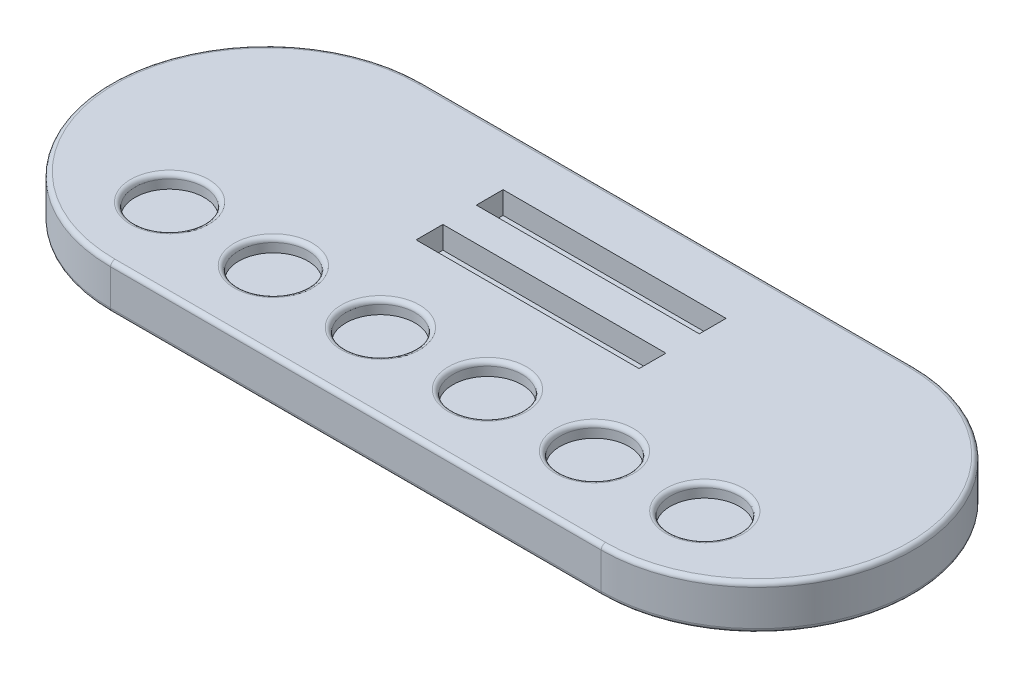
ISO-10303-21;
HEADER;
FILE_DESCRIPTION(('STEP AP214'),'2;1');
FILE_NAME('part.step','',(''),(''),'','','');
FILE_SCHEMA(('AUTOMOTIVE_DESIGN { 1 0 10303 214 1 1 1 1 }'));
ENDSEC;
DATA;
#1=APPLICATION_CONTEXT('core data for automotive mechanical design processes');
#2=APPLICATION_PROTOCOL_DEFINITION('international standard','automotive_design',2000,#1);
#3=PRODUCT_CONTEXT('',#1,'mechanical');
#4=PRODUCT('Part','Part','',(#3));
#5=PRODUCT_RELATED_PRODUCT_CATEGORY('part','',(#4));
#6=PRODUCT_DEFINITION_FORMATION('','',#4);
#7=PRODUCT_DEFINITION_CONTEXT('part definition',#1,'design');
#8=PRODUCT_DEFINITION('design','',#6,#7);
#9=PRODUCT_DEFINITION_SHAPE('','',#8);
#10=(LENGTH_UNIT() NAMED_UNIT(*) SI_UNIT(.MILLI.,.METRE.));
#11=(NAMED_UNIT(*) PLANE_ANGLE_UNIT() SI_UNIT($,.RADIAN.));
#12=(NAMED_UNIT(*) SI_UNIT($,.STERADIAN.) SOLID_ANGLE_UNIT());
#13=UNCERTAINTY_MEASURE_WITH_UNIT(LENGTH_MEASURE(1.E-05),#10,'distance_accuracy_value','');
#14=(GEOMETRIC_REPRESENTATION_CONTEXT(3) GLOBAL_UNCERTAINTY_ASSIGNED_CONTEXT((#13)) GLOBAL_UNIT_ASSIGNED_CONTEXT((#10,
#11,#12)) REPRESENTATION_CONTEXT('',''));
#15=CARTESIAN_POINT('',(0.,0.,0.));
#16=DIRECTION('',(0.,0.,1.));
#17=DIRECTION('',(1.,0.,0.));
#18=AXIS2_PLACEMENT_3D('',#15,#16,#17);
#19=CARTESIAN_POINT('',(-110.,10.,46.));
#20=DIRECTION('',(0.,-1.,0.));
#21=DIRECTION('',(0.,0.,-1.));
#22=AXIS2_PLACEMENT_3D('',#19,#20,#21);
#23=CYLINDRICAL_SURFACE('',#22,70.);
#24=DIRECTION('',(0.,-1.,0.));
#25=VECTOR('',#24,1.);
#26=CARTESIAN_POINT('',(-110.,10.,-24.));
#27=LINE('',#26,#25);
#28=CARTESIAN_POINT('',(-110.,8.,-24.));
#29=VERTEX_POINT('',#28);
#30=CARTESIAN_POINT('',(-110.,-8.,-24.));
#31=VERTEX_POINT('',#30);
#32=EDGE_CURVE('E196',#29,#31,#27,.T.);
#33=ORIENTED_EDGE('',*,*,#32,.T.);
#34=CARTESIAN_POINT('',(-110.,-8.,46.));
#35=DIRECTION('',(0.,-1.,0.));
#36=DIRECTION('',(0.,0.,-1.));
#37=AXIS2_PLACEMENT_3D('',#34,#35,#36);
#38=CIRCLE('',#37,70.);
#39=CARTESIAN_POINT('',(-110.,-8.,116.));
#40=VERTEX_POINT('',#39);
#41=EDGE_CURVE('E214',#31,#40,#38,.F.);
#42=ORIENTED_EDGE('',*,*,#41,.T.);
#43=DIRECTION('',(0.,-1.,0.));
#44=VECTOR('',#43,1.);
#45=CARTESIAN_POINT('',(-110.,10.,116.));
#46=LINE('',#45,#44);
#47=CARTESIAN_POINT('',(-110.,8.,116.));
#48=VERTEX_POINT('',#47);
#49=EDGE_CURVE('E186',#48,#40,#46,.T.);
#50=ORIENTED_EDGE('',*,*,#49,.F.);
#51=CARTESIAN_POINT('',(-110.,8.,46.));
#52=DIRECTION('',(0.,-1.,0.));
#53=DIRECTION('',(0.,0.,-1.));
#54=AXIS2_PLACEMENT_3D('',#51,#52,#53);
#55=CIRCLE('',#54,70.);
#56=EDGE_CURVE('E212',#48,#29,#55,.T.);
#57=ORIENTED_EDGE('',*,*,#56,.T.);
#58=EDGE_LOOP('',(#33,#42,#50,#57));
#59=FACE_BOUND('',#58,.T.);
#60=ADVANCED_FACE('F35',(#59),#23,.T.);
#61=CARTESIAN_POINT('',(-110.,10.,116.));
#62=DIRECTION('',(0.,0.,1.));
#63=DIRECTION('',(1.,0.,0.));
#64=AXIS2_PLACEMENT_3D('',#61,#62,#63);
#65=PLANE('',#64);
#66=ORIENTED_EDGE('',*,*,#49,.T.);
#67=DIRECTION('',(-1.,0.,0.));
#68=VECTOR('',#67,1.);
#69=CARTESIAN_POINT('',(-110.,-8.,116.));
#70=LINE('',#69,#68);
#71=CARTESIAN_POINT('',(110.,-8.,116.));
#72=VERTEX_POINT('',#71);
#73=EDGE_CURVE('E219',#40,#72,#70,.F.);
#74=ORIENTED_EDGE('',*,*,#73,.T.);
#75=DIRECTION('',(0.,-1.,0.));
#76=VECTOR('',#75,1.);
#77=CARTESIAN_POINT('',(110.,10.,116.));
#78=LINE('',#77,#76);
#79=CARTESIAN_POINT('',(110.,8.,116.));
#80=VERTEX_POINT('',#79);
#81=EDGE_CURVE('E190',#80,#72,#78,.T.);
#82=ORIENTED_EDGE('',*,*,#81,.F.);
#83=DIRECTION('',(-1.,0.,0.));
#84=VECTOR('',#83,1.);
#85=CARTESIAN_POINT('',(-110.,8.,116.));
#86=LINE('',#85,#84);
#87=EDGE_CURVE('E216',#80,#48,#86,.T.);
#88=ORIENTED_EDGE('',*,*,#87,.T.);
#89=EDGE_LOOP('',(#66,#74,#82,#88));
#90=FACE_BOUND('',#89,.T.);
#91=ADVANCED_FACE('F301',(#90),#65,.T.);
#92=CARTESIAN_POINT('',(110.,10.,46.));
#93=DIRECTION('',(0.,-1.,0.));
#94=DIRECTION('',(0.,0.,-1.));
#95=AXIS2_PLACEMENT_3D('',#92,#93,#94);
#96=CYLINDRICAL_SURFACE('',#95,70.);
#97=DIRECTION('',(0.,-1.,0.));
#98=VECTOR('',#97,1.);
#99=CARTESIAN_POINT('',(110.,10.,-24.));
#100=LINE('',#99,#98);
#101=CARTESIAN_POINT('',(110.,8.,-24.));
#102=VERTEX_POINT('',#101);
#103=CARTESIAN_POINT('',(110.,-8.,-24.));
#104=VERTEX_POINT('',#103);
#105=EDGE_CURVE('E193',#102,#104,#100,.T.);
#106=ORIENTED_EDGE('',*,*,#105,.F.);
#107=CARTESIAN_POINT('',(110.,8.,46.));
#108=DIRECTION('',(0.,-1.,0.));
#109=DIRECTION('',(0.,0.,-1.));
#110=AXIS2_PLACEMENT_3D('',#107,#108,#109);
#111=CIRCLE('',#110,70.);
#112=EDGE_CURVE('E248',#102,#80,#111,.T.);
#113=ORIENTED_EDGE('',*,*,#112,.T.);
#114=ORIENTED_EDGE('',*,*,#81,.T.);
#115=CARTESIAN_POINT('',(110.,-8.,46.));
#116=DIRECTION('',(0.,-1.,0.));
#117=DIRECTION('',(0.,0.,-1.));
#118=AXIS2_PLACEMENT_3D('',#115,#116,#117);
#119=CIRCLE('',#118,70.);
#120=EDGE_CURVE('E246',#72,#104,#119,.F.);
#121=ORIENTED_EDGE('',*,*,#120,.T.);
#122=EDGE_LOOP('',(#106,#113,#114,#121));
#123=FACE_BOUND('',#122,.T.);
#124=ADVANCED_FACE('F328',(#123),#96,.T.);
#125=CARTESIAN_POINT('',(-110.,10.,-24.));
#126=DIRECTION('',(0.,0.,-1.));
#127=DIRECTION('',(-1.,0.,0.));
#128=AXIS2_PLACEMENT_3D('',#125,#126,#127);
#129=PLANE('',#128);
#130=ORIENTED_EDGE('',*,*,#105,.T.);
#131=DIRECTION('',(1.,0.,0.));
#132=VECTOR('',#131,1.);
#133=CARTESIAN_POINT('',(-110.,-8.,-24.));
#134=LINE('',#133,#132);
#135=EDGE_CURVE('E209',#104,#31,#134,.F.);
#136=ORIENTED_EDGE('',*,*,#135,.T.);
#137=ORIENTED_EDGE('',*,*,#32,.F.);
#138=DIRECTION('',(1.,0.,0.));
#139=VECTOR('',#138,1.);
#140=CARTESIAN_POINT('',(110.,8.,-24.));
#141=LINE('',#140,#139);
#142=EDGE_CURVE('E207',#29,#102,#141,.T.);
#143=ORIENTED_EDGE('',*,*,#142,.T.);
#144=EDGE_LOOP('',(#130,#136,#137,#143));
#145=FACE_BOUND('',#144,.T.);
#146=ADVANCED_FACE('F312',(#145),#129,.T.);
#147=CARTESIAN_POINT('',(-110.,10.,46.));
#148=DIRECTION('',(0.,-1.,0.));
#149=DIRECTION('',(0.,0.,-1.));
#150=AXIS2_PLACEMENT_3D('',#147,#148,#149);
#151=PLANE('',#150);
#152=CARTESIAN_POINT('',(120.,10.,79.5410196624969));
#153=DIRECTION('',(0.,-1.,0.));
#154=DIRECTION('',(0.,0.,-1.));
#155=AXIS2_PLACEMENT_3D('',#152,#153,#154);
#156=CIRCLE('',#155,17.5);
#157=CARTESIAN_POINT('',(120.,10.,62.0410196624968));
#158=VERTEX_POINT('',#157);
#159=EDGE_CURVE('E243',#158,#158,#156,.T.);
#160=ORIENTED_EDGE('',*,*,#159,.T.);
#161=EDGE_LOOP('',(#160));
#162=FACE_BOUND('',#161,.T.);
#163=CARTESIAN_POINT('',(72.,10.,81.));
#164=DIRECTION('',(0.,-1.,0.));
#165=DIRECTION('',(0.,0.,-1.));
#166=AXIS2_PLACEMENT_3D('',#163,#164,#165);
#167=CIRCLE('',#166,17.5);
#168=CARTESIAN_POINT('',(72.,10.,63.5));
#169=VERTEX_POINT('',#168);
#170=EDGE_CURVE('E240',#169,#169,#167,.T.);
#171=ORIENTED_EDGE('',*,*,#170,.T.);
#172=EDGE_LOOP('',(#171));
#173=FACE_BOUND('',#172,.T.);
#174=CARTESIAN_POINT('',(24.,10.,81.));
#175=DIRECTION('',(0.,-1.,0.));
#176=DIRECTION('',(0.,0.,-1.));
#177=AXIS2_PLACEMENT_3D('',#174,#175,#176);
#178=CIRCLE('',#177,17.5);
#179=CARTESIAN_POINT('',(24.,10.,63.5));
#180=VERTEX_POINT('',#179);
#181=EDGE_CURVE('E237',#180,#180,#178,.T.);
#182=ORIENTED_EDGE('',*,*,#181,.T.);
#183=EDGE_LOOP('',(#182));
#184=FACE_BOUND('',#183,.T.);
#185=CARTESIAN_POINT('',(-24.,10.,81.));
#186=DIRECTION('',(0.,-1.,0.));
#187=DIRECTION('',(0.,0.,-1.));
#188=AXIS2_PLACEMENT_3D('',#185,#186,#187);
#189=CIRCLE('',#188,17.5);
#190=CARTESIAN_POINT('',(-24.,10.,63.5));
#191=VERTEX_POINT('',#190);
#192=EDGE_CURVE('E234',#191,#191,#189,.T.);
#193=ORIENTED_EDGE('',*,*,#192,.T.);
#194=EDGE_LOOP('',(#193));
#195=FACE_BOUND('',#194,.T.);
#196=CARTESIAN_POINT('',(-72.,10.,81.));
#197=DIRECTION('',(0.,-1.,0.));
#198=DIRECTION('',(0.,0.,-1.));
#199=AXIS2_PLACEMENT_3D('',#196,#197,#198);
#200=CIRCLE('',#199,17.5);
#201=CARTESIAN_POINT('',(-72.,10.,63.5));
#202=VERTEX_POINT('',#201);
#203=EDGE_CURVE('E231',#202,#202,#200,.T.);
#204=ORIENTED_EDGE('',*,*,#203,.T.);
#205=EDGE_LOOP('',(#204));
#206=FACE_BOUND('',#205,.T.);
#207=CARTESIAN_POINT('',(-120.,10.,79.5410196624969));
#208=DIRECTION('',(0.,-1.,0.));
#209=DIRECTION('',(0.,0.,-1.));
#210=AXIS2_PLACEMENT_3D('',#207,#208,#209);
#211=CIRCLE('',#210,17.5);
#212=CARTESIAN_POINT('',(-120.,10.,62.0410196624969));
#213=VERTEX_POINT('',#212);
#214=EDGE_CURVE('E228',#213,#213,#211,.T.);
#215=ORIENTED_EDGE('',*,*,#214,.T.);
#216=EDGE_LOOP('',(#215));
#217=FACE_BOUND('',#216,.T.);
#218=CARTESIAN_POINT('',(-110.,10.,46.));
#219=DIRECTION('',(0.,-1.,0.));
#220=DIRECTION('',(0.,0.,-1.));
#221=AXIS2_PLACEMENT_3D('',#218,#219,#220);
#222=CIRCLE('',#221,68.);
#223=CARTESIAN_POINT('',(-110.,10.,-22.));
#224=VERTEX_POINT('',#223);
#225=CARTESIAN_POINT('',(-110.,10.,114.));
#226=VERTEX_POINT('',#225);
#227=EDGE_CURVE('E221',#224,#226,#222,.F.);
#228=ORIENTED_EDGE('',*,*,#227,.T.);
#229=DIRECTION('',(-1.,0.,0.));
#230=VECTOR('',#229,1.);
#231=CARTESIAN_POINT('',(110.,10.,114.));
#232=LINE('',#231,#230);
#233=CARTESIAN_POINT('',(110.,10.,114.));
#234=VERTEX_POINT('',#233);
#235=EDGE_CURVE('E226',#226,#234,#232,.F.);
#236=ORIENTED_EDGE('',*,*,#235,.T.);
#237=CARTESIAN_POINT('',(110.,10.,46.));
#238=DIRECTION('',(0.,-1.,0.));
#239=DIRECTION('',(0.,0.,-1.));
#240=AXIS2_PLACEMENT_3D('',#237,#238,#239);
#241=CIRCLE('',#240,68.);
#242=CARTESIAN_POINT('',(110.,10.,-22.));
#243=VERTEX_POINT('',#242);
#244=EDGE_CURVE('E59',#234,#243,#241,.F.);
#245=ORIENTED_EDGE('',*,*,#244,.T.);
#246=DIRECTION('',(1.,0.,0.));
#247=VECTOR('',#246,1.);
#248=CARTESIAN_POINT('',(-110.,10.,-22.));
#249=LINE('',#248,#247);
#250=EDGE_CURVE('E223',#243,#224,#249,.F.);
#251=ORIENTED_EDGE('',*,*,#250,.T.);
#252=EDGE_LOOP('',(#228,#236,#245,#251));
#253=FACE_BOUND('',#252,.T.);
#254=DIRECTION('',(-1.,0.,0.));
#255=VECTOR('',#254,1.);
#256=CARTESIAN_POINT('',(50.,10.,39.));
#257=LINE('',#256,#255);
#258=CARTESIAN_POINT('',(50.,10.,39.));
#259=VERTEX_POINT('',#258);
#260=CARTESIAN_POINT('',(-50.,10.,39.));
#261=VERTEX_POINT('',#260);
#262=EDGE_CURVE('E420',#259,#261,#257,.T.);
#263=ORIENTED_EDGE('',*,*,#262,.T.);
#264=DIRECTION('',(0.,0.,-1.));
#265=VECTOR('',#264,1.);
#266=CARTESIAN_POINT('',(-50.,10.,39.));
#267=LINE('',#266,#265);
#268=CARTESIAN_POINT('',(-50.,10.,27.));
#269=VERTEX_POINT('',#268);
#270=EDGE_CURVE('E410',#261,#269,#267,.T.);
#271=ORIENTED_EDGE('',*,*,#270,.T.);
#272=DIRECTION('',(1.,0.,0.));
#273=VECTOR('',#272,1.);
#274=CARTESIAN_POINT('',(-50.,10.,27.));
#275=LINE('',#274,#273);
#276=CARTESIAN_POINT('',(50.,10.,27.));
#277=VERTEX_POINT('',#276);
#278=EDGE_CURVE('E413',#269,#277,#275,.T.);
#279=ORIENTED_EDGE('',*,*,#278,.T.);
#280=DIRECTION('',(0.,0.,1.));
#281=VECTOR('',#280,1.);
#282=CARTESIAN_POINT('',(50.,10.,27.));
#283=LINE('',#282,#281);
#284=EDGE_CURVE('E417',#277,#259,#283,.T.);
#285=ORIENTED_EDGE('',*,*,#284,.T.);
#286=EDGE_LOOP('',(#263,#271,#279,#285));
#287=FACE_BOUND('',#286,.T.);
#288=DIRECTION('',(-1.,0.,0.));
#289=VECTOR('',#288,1.);
#290=CARTESIAN_POINT('',(50.,10.,12.));
#291=LINE('',#290,#289);
#292=CARTESIAN_POINT('',(50.,10.,12.));
#293=VERTEX_POINT('',#292);
#294=CARTESIAN_POINT('',(-50.,10.,12.));
#295=VERTEX_POINT('',#294);
#296=EDGE_CURVE('E177',#293,#295,#291,.T.);
#297=ORIENTED_EDGE('',*,*,#296,.T.);
#298=DIRECTION('',(0.,0.,-1.));
#299=VECTOR('',#298,1.);
#300=CARTESIAN_POINT('',(-50.,10.,12.));
#301=LINE('',#300,#299);
#302=CARTESIAN_POINT('',(-50.,10.,0.));
#303=VERTEX_POINT('',#302);
#304=EDGE_CURVE('E444',#295,#303,#301,.T.);
#305=ORIENTED_EDGE('',*,*,#304,.T.);
#306=DIRECTION('',(1.,0.,0.));
#307=VECTOR('',#306,1.);
#308=CARTESIAN_POINT('',(-50.,10.,0.));
#309=LINE('',#308,#307);
#310=CARTESIAN_POINT('',(50.,10.,0.));
#311=VERTEX_POINT('',#310);
#312=EDGE_CURVE('E174',#303,#311,#309,.T.);
#313=ORIENTED_EDGE('',*,*,#312,.T.);
#314=DIRECTION('',(0.,0.,1.));
#315=VECTOR('',#314,1.);
#316=CARTESIAN_POINT('',(50.,10.,0.));
#317=LINE('',#316,#315);
#318=EDGE_CURVE('E182',#311,#293,#317,.T.);
#319=ORIENTED_EDGE('',*,*,#318,.T.);
#320=EDGE_LOOP('',(#297,#305,#313,#319));
#321=FACE_BOUND('',#320,.T.);
#322=ADVANCED_FACE('F291',(#162,#173,#184,#195,#206,#217,#253,#287,#321),#151,.F.);
#323=CARTESIAN_POINT('',(-50.,10.,12.));
#324=DIRECTION('',(-1.,0.,0.));
#325=DIRECTION('',(0.,0.,1.));
#326=AXIS2_PLACEMENT_3D('',#323,#324,#325);
#327=PLANE('',#326);
#328=DIRECTION('',(0.,0.,-1.));
#329=VECTOR('',#328,1.);
#330=CARTESIAN_POINT('',(-50.,0.,12.));
#331=LINE('',#330,#329);
#332=CARTESIAN_POINT('',(-50.,0.,12.));
#333=VERTEX_POINT('',#332);
#334=CARTESIAN_POINT('',(-50.,0.,0.));
#335=VERTEX_POINT('',#334);
#336=EDGE_CURVE('E154',#333,#335,#331,.T.);
#337=ORIENTED_EDGE('',*,*,#336,.T.);
#338=DIRECTION('',(0.,-1.,0.));
#339=VECTOR('',#338,1.);
#340=CARTESIAN_POINT('',(-50.,10.,0.));
#341=LINE('',#340,#339);
#342=EDGE_CURVE('E166',#303,#335,#341,.T.);
#343=ORIENTED_EDGE('',*,*,#342,.F.);
#344=ORIENTED_EDGE('',*,*,#304,.F.);
#345=DIRECTION('',(0.,-1.,0.));
#346=VECTOR('',#345,1.);
#347=CARTESIAN_POINT('',(-50.,10.,12.));
#348=LINE('',#347,#346);
#349=EDGE_CURVE('E168',#295,#333,#348,.T.);
#350=ORIENTED_EDGE('',*,*,#349,.T.);
#351=EDGE_LOOP('',(#337,#343,#344,#350));
#352=FACE_BOUND('',#351,.T.);
#353=ADVANCED_FACE('F164',(#352),#327,.F.);
#354=CARTESIAN_POINT('',(50.,10.,12.));
#355=DIRECTION('',(0.,0.,1.));
#356=DIRECTION('',(1.,0.,0.));
#357=AXIS2_PLACEMENT_3D('',#354,#355,#356);
#358=PLANE('',#357);
#359=DIRECTION('',(-1.,0.,0.));
#360=VECTOR('',#359,1.);
#361=CARTESIAN_POINT('',(50.,0.,12.));
#362=LINE('',#361,#360);
#363=CARTESIAN_POINT('',(50.,0.,12.));
#364=VERTEX_POINT('',#363);
#365=EDGE_CURVE('E446',#364,#333,#362,.T.);
#366=ORIENTED_EDGE('',*,*,#365,.T.);
#367=ORIENTED_EDGE('',*,*,#349,.F.);
#368=ORIENTED_EDGE('',*,*,#296,.F.);
#369=DIRECTION('',(0.,-1.,0.));
#370=VECTOR('',#369,1.);
#371=CARTESIAN_POINT('',(50.,10.,12.));
#372=LINE('',#371,#370);
#373=EDGE_CURVE('E179',#293,#364,#372,.T.);
#374=ORIENTED_EDGE('',*,*,#373,.T.);
#375=EDGE_LOOP('',(#366,#367,#368,#374));
#376=FACE_BOUND('',#375,.T.);
#377=ADVANCED_FACE('F455',(#376),#358,.F.);
#378=CARTESIAN_POINT('',(50.,10.,0.));
#379=DIRECTION('',(1.,0.,0.));
#380=DIRECTION('',(0.,0.,-1.));
#381=AXIS2_PLACEMENT_3D('',#378,#379,#380);
#382=PLANE('',#381);
#383=DIRECTION('',(0.,0.,1.));
#384=VECTOR('',#383,1.);
#385=CARTESIAN_POINT('',(50.,0.,0.));
#386=LINE('',#385,#384);
#387=CARTESIAN_POINT('',(50.,0.,0.));
#388=VERTEX_POINT('',#387);
#389=EDGE_CURVE('E157',#388,#364,#386,.T.);
#390=ORIENTED_EDGE('',*,*,#389,.T.);
#391=ORIENTED_EDGE('',*,*,#373,.F.);
#392=ORIENTED_EDGE('',*,*,#318,.F.);
#393=DIRECTION('',(0.,-1.,0.));
#394=VECTOR('',#393,1.);
#395=CARTESIAN_POINT('',(50.,10.,0.));
#396=LINE('',#395,#394);
#397=EDGE_CURVE('E176',#311,#388,#396,.T.);
#398=ORIENTED_EDGE('',*,*,#397,.T.);
#399=EDGE_LOOP('',(#390,#391,#392,#398));
#400=FACE_BOUND('',#399,.T.);
#401=ADVANCED_FACE('F457',(#400),#382,.F.);
#402=CARTESIAN_POINT('',(-50.,10.,0.));
#403=DIRECTION('',(0.,0.,-1.));
#404=DIRECTION('',(-1.,0.,0.));
#405=AXIS2_PLACEMENT_3D('',#402,#403,#404);
#406=PLANE('',#405);
#407=DIRECTION('',(1.,0.,0.));
#408=VECTOR('',#407,1.);
#409=CARTESIAN_POINT('',(-50.,0.,0.));
#410=LINE('',#409,#408);
#411=EDGE_CURVE('E151',#335,#388,#410,.T.);
#412=ORIENTED_EDGE('',*,*,#411,.T.);
#413=ORIENTED_EDGE('',*,*,#397,.F.);
#414=ORIENTED_EDGE('',*,*,#312,.F.);
#415=ORIENTED_EDGE('',*,*,#342,.T.);
#416=EDGE_LOOP('',(#412,#413,#414,#415));
#417=FACE_BOUND('',#416,.T.);
#418=ADVANCED_FACE('F172',(#417),#406,.F.);
#419=CARTESIAN_POINT('',(-50.,10.,39.));
#420=DIRECTION('',(-1.,0.,0.));
#421=DIRECTION('',(0.,0.,1.));
#422=AXIS2_PLACEMENT_3D('',#419,#420,#421);
#423=PLANE('',#422);
#424=DIRECTION('',(0.,0.,-1.));
#425=VECTOR('',#424,1.);
#426=CARTESIAN_POINT('',(-50.,0.,39.));
#427=LINE('',#426,#425);
#428=CARTESIAN_POINT('',(-50.,0.,39.));
#429=VERTEX_POINT('',#428);
#430=CARTESIAN_POINT('',(-50.,0.,27.));
#431=VERTEX_POINT('',#430);
#432=EDGE_CURVE('E398',#429,#431,#427,.T.);
#433=ORIENTED_EDGE('',*,*,#432,.T.);
#434=DIRECTION('',(0.,-1.,0.));
#435=VECTOR('',#434,1.);
#436=CARTESIAN_POINT('',(-50.,10.,27.));
#437=LINE('',#436,#435);
#438=EDGE_CURVE('E423',#269,#431,#437,.T.);
#439=ORIENTED_EDGE('',*,*,#438,.F.);
#440=ORIENTED_EDGE('',*,*,#270,.F.);
#441=DIRECTION('',(0.,-1.,0.));
#442=VECTOR('',#441,1.);
#443=CARTESIAN_POINT('',(-50.,10.,39.));
#444=LINE('',#443,#442);
#445=EDGE_CURVE('E170',#261,#429,#444,.T.);
#446=ORIENTED_EDGE('',*,*,#445,.T.);
#447=EDGE_LOOP('',(#433,#439,#440,#446));
#448=FACE_BOUND('',#447,.T.);
#449=ADVANCED_FACE('F470',(#448),#423,.F.);
#450=CARTESIAN_POINT('',(50.,10.,39.));
#451=DIRECTION('',(0.,0.,1.));
#452=DIRECTION('',(1.,0.,0.));
#453=AXIS2_PLACEMENT_3D('',#450,#451,#452);
#454=PLANE('',#453);
#455=DIRECTION('',(-1.,0.,0.));
#456=VECTOR('',#455,1.);
#457=CARTESIAN_POINT('',(50.,0.,39.));
#458=LINE('',#457,#456);
#459=CARTESIAN_POINT('',(50.,0.,39.));
#460=VERTEX_POINT('',#459);
#461=EDGE_CURVE('E414',#460,#429,#458,.T.);
#462=ORIENTED_EDGE('',*,*,#461,.T.);
#463=ORIENTED_EDGE('',*,*,#445,.F.);
#464=ORIENTED_EDGE('',*,*,#262,.F.);
#465=DIRECTION('',(0.,-1.,0.));
#466=VECTOR('',#465,1.);
#467=CARTESIAN_POINT('',(50.,10.,39.));
#468=LINE('',#467,#466);
#469=EDGE_CURVE('E436',#259,#460,#468,.T.);
#470=ORIENTED_EDGE('',*,*,#469,.T.);
#471=EDGE_LOOP('',(#462,#463,#464,#470));
#472=FACE_BOUND('',#471,.T.);
#473=ADVANCED_FACE('F477',(#472),#454,.F.);
#474=CARTESIAN_POINT('',(50.,10.,27.));
#475=DIRECTION('',(1.,0.,0.));
#476=DIRECTION('',(0.,0.,-1.));
#477=AXIS2_PLACEMENT_3D('',#474,#475,#476);
#478=PLANE('',#477);
#479=DIRECTION('',(0.,0.,1.));
#480=VECTOR('',#479,1.);
#481=CARTESIAN_POINT('',(50.,0.,27.));
#482=LINE('',#481,#480);
#483=CARTESIAN_POINT('',(50.,0.,27.));
#484=VERTEX_POINT('',#483);
#485=EDGE_CURVE('E429',#484,#460,#482,.T.);
#486=ORIENTED_EDGE('',*,*,#485,.T.);
#487=ORIENTED_EDGE('',*,*,#469,.F.);
#488=ORIENTED_EDGE('',*,*,#284,.F.);
#489=DIRECTION('',(0.,-1.,0.));
#490=VECTOR('',#489,1.);
#491=CARTESIAN_POINT('',(50.,10.,27.));
#492=LINE('',#491,#490);
#493=EDGE_CURVE('E439',#277,#484,#492,.T.);
#494=ORIENTED_EDGE('',*,*,#493,.T.);
#495=EDGE_LOOP('',(#486,#487,#488,#494));
#496=FACE_BOUND('',#495,.T.);
#497=ADVANCED_FACE('F482',(#496),#478,.F.);
#498=CARTESIAN_POINT('',(-50.,10.,27.));
#499=DIRECTION('',(0.,0.,-1.));
#500=DIRECTION('',(-1.,0.,0.));
#501=AXIS2_PLACEMENT_3D('',#498,#499,#500);
#502=PLANE('',#501);
#503=DIRECTION('',(1.,0.,0.));
#504=VECTOR('',#503,1.);
#505=CARTESIAN_POINT('',(-50.,0.,27.));
#506=LINE('',#505,#504);
#507=EDGE_CURVE('E426',#431,#484,#506,.T.);
#508=ORIENTED_EDGE('',*,*,#507,.T.);
#509=ORIENTED_EDGE('',*,*,#493,.F.);
#510=ORIENTED_EDGE('',*,*,#278,.F.);
#511=ORIENTED_EDGE('',*,*,#438,.T.);
#512=EDGE_LOOP('',(#508,#509,#510,#511));
#513=FACE_BOUND('',#512,.T.);
#514=ADVANCED_FACE('F479',(#513),#502,.F.);
#515=CARTESIAN_POINT('',(-110.,0.,46.));
#516=DIRECTION('',(0.,-1.,0.));
#517=DIRECTION('',(0.,0.,-1.));
#518=AXIS2_PLACEMENT_3D('',#515,#516,#517);
#519=PLANE('',#518);
#520=ORIENTED_EDGE('',*,*,#336,.F.);
#521=ORIENTED_EDGE('',*,*,#365,.F.);
#522=ORIENTED_EDGE('',*,*,#389,.F.);
#523=ORIENTED_EDGE('',*,*,#411,.F.);
#524=EDGE_LOOP('',(#520,#521,#522,#523));
#525=FACE_BOUND('',#524,.T.);
#526=ADVANCED_FACE('F153',(#525),#519,.F.);
#527=ORIENTED_EDGE('',*,*,#432,.F.);
#528=ORIENTED_EDGE('',*,*,#461,.F.);
#529=ORIENTED_EDGE('',*,*,#485,.F.);
#530=ORIENTED_EDGE('',*,*,#507,.F.);
#531=EDGE_LOOP('',(#527,#528,#529,#530));
#532=FACE_BOUND('',#531,.T.);
#533=ADVANCED_FACE('F492',(#532),#519,.F.);
#534=CARTESIAN_POINT('',(-110.,-10.,46.));
#535=DIRECTION('',(0.,-1.,0.));
#536=DIRECTION('',(0.,0.,-1.));
#537=AXIS2_PLACEMENT_3D('',#534,#535,#536);
#538=PLANE('',#537);
#539=CARTESIAN_POINT('',(-110.,-10.,46.));
#540=DIRECTION('',(0.,-1.,0.));
#541=DIRECTION('',(0.,0.,-1.));
#542=AXIS2_PLACEMENT_3D('',#539,#540,#541);
#543=CIRCLE('',#542,68.);
#544=CARTESIAN_POINT('',(-110.,-10.,114.));
#545=VERTEX_POINT('',#544);
#546=CARTESIAN_POINT('',(-110.,-10.,-22.));
#547=VERTEX_POINT('',#546);
#548=EDGE_CURVE('E202',#545,#547,#543,.T.);
#549=ORIENTED_EDGE('',*,*,#548,.T.);
#550=DIRECTION('',(1.,0.,0.));
#551=VECTOR('',#550,1.);
#552=CARTESIAN_POINT('',(-110.,-10.,-22.));
#553=LINE('',#552,#551);
#554=CARTESIAN_POINT('',(110.,-10.,-22.));
#555=VERTEX_POINT('',#554);
#556=EDGE_CURVE('E204',#547,#555,#553,.T.);
#557=ORIENTED_EDGE('',*,*,#556,.T.);
#558=CARTESIAN_POINT('',(110.,-10.,46.));
#559=DIRECTION('',(0.,-1.,0.));
#560=DIRECTION('',(0.,0.,-1.));
#561=AXIS2_PLACEMENT_3D('',#558,#559,#560);
#562=CIRCLE('',#561,68.);
#563=CARTESIAN_POINT('',(110.,-10.,114.));
#564=VERTEX_POINT('',#563);
#565=EDGE_CURVE('E189',#555,#564,#562,.T.);
#566=ORIENTED_EDGE('',*,*,#565,.T.);
#567=DIRECTION('',(-1.,0.,0.));
#568=VECTOR('',#567,1.);
#569=CARTESIAN_POINT('',(-110.,-10.,114.));
#570=LINE('',#569,#568);
#571=EDGE_CURVE('E200',#564,#545,#570,.T.);
#572=ORIENTED_EDGE('',*,*,#571,.T.);
#573=EDGE_LOOP('',(#549,#557,#566,#572));
#574=FACE_BOUND('',#573,.T.);
#575=ADVANCED_FACE('F324',(#574),#538,.T.);
#576=CARTESIAN_POINT('',(-24.,4.,81.));
#577=DIRECTION('',(0.,1.,0.));
#578=DIRECTION('',(0.,0.,1.));
#579=AXIS2_PLACEMENT_3D('',#576,#577,#578);
#580=CYLINDRICAL_SURFACE('',#579,15.5);
#581=CARTESIAN_POINT('',(-24.,8.,81.));
#582=DIRECTION('',(0.,-1.,0.));
#583=DIRECTION('',(0.,0.,-1.));
#584=AXIS2_PLACEMENT_3D('',#581,#582,#583);
#585=CIRCLE('',#584,15.5);
#586=CARTESIAN_POINT('',(-24.,8.,65.5));
#587=VERTEX_POINT('',#586);
#588=EDGE_CURVE('E259',#587,#587,#585,.F.);
#589=ORIENTED_EDGE('',*,*,#588,.T.);
#590=EDGE_LOOP('',(#589));
#591=FACE_BOUND('',#590,.T.);
#592=CARTESIAN_POINT('',(-24.,4.,81.));
#593=DIRECTION('',(0.,1.,0.));
#594=DIRECTION('',(0.,0.,1.));
#595=AXIS2_PLACEMENT_3D('',#592,#593,#594);
#596=CIRCLE('',#595,15.5);
#597=CARTESIAN_POINT('',(-24.,4.,96.5));
#598=VERTEX_POINT('',#597);
#599=EDGE_CURVE('E394',#598,#598,#596,.T.);
#600=ORIENTED_EDGE('',*,*,#599,.F.);
#601=EDGE_LOOP('',(#600));
#602=FACE_BOUND('',#601,.T.);
#603=ADVANCED_FACE('F495',(#591,#602),#580,.F.);
#604=CARTESIAN_POINT('',(-24.,4.,81.));
#605=DIRECTION('',(0.,1.,0.));
#606=DIRECTION('',(0.,0.,1.));
#607=AXIS2_PLACEMENT_3D('',#604,#605,#606);
#608=PLANE('',#607);
#609=ORIENTED_EDGE('',*,*,#599,.T.);
#610=EDGE_LOOP('',(#609));
#611=FACE_BOUND('',#610,.T.);
#612=ADVANCED_FACE('F498',(#611),#608,.T.);
#613=CARTESIAN_POINT('',(24.,4.,81.));
#614=DIRECTION('',(0.,1.,0.));
#615=DIRECTION('',(0.,0.,1.));
#616=AXIS2_PLACEMENT_3D('',#613,#614,#615);
#617=CYLINDRICAL_SURFACE('',#616,15.5);
#618=CARTESIAN_POINT('',(24.,8.,81.));
#619=DIRECTION('',(0.,-1.,0.));
#620=DIRECTION('',(0.,0.,-1.));
#621=AXIS2_PLACEMENT_3D('',#618,#619,#620);
#622=CIRCLE('',#621,15.5);
#623=CARTESIAN_POINT('',(24.,8.,65.5));
#624=VERTEX_POINT('',#623);
#625=EDGE_CURVE('E256',#624,#624,#622,.F.);
#626=ORIENTED_EDGE('',*,*,#625,.T.);
#627=EDGE_LOOP('',(#626));
#628=FACE_BOUND('',#627,.T.);
#629=CARTESIAN_POINT('',(24.,4.,81.));
#630=DIRECTION('',(0.,1.,0.));
#631=DIRECTION('',(0.,0.,-1.));
#632=AXIS2_PLACEMENT_3D('',#629,#630,#631);
#633=CIRCLE('',#632,15.5);
#634=CARTESIAN_POINT('',(24.,4.,65.5));
#635=VERTEX_POINT('',#634);
#636=EDGE_CURVE('E274',#635,#635,#633,.T.);
#637=ORIENTED_EDGE('',*,*,#636,.F.);
#638=EDGE_LOOP('',(#637));
#639=FACE_BOUND('',#638,.T.);
#640=ADVANCED_FACE('F502',(#628,#639),#617,.F.);
#641=CARTESIAN_POINT('',(24.,4.,81.));
#642=DIRECTION('',(0.,-1.,0.));
#643=DIRECTION('',(0.,0.,-1.));
#644=AXIS2_PLACEMENT_3D('',#641,#642,#643);
#645=PLANE('',#644);
#646=ORIENTED_EDGE('',*,*,#636,.T.);
#647=EDGE_LOOP('',(#646));
#648=FACE_BOUND('',#647,.T.);
#649=ADVANCED_FACE('F508',(#648),#645,.F.);
#650=CARTESIAN_POINT('',(72.,4.,81.));
#651=DIRECTION('',(0.,1.,0.));
#652=DIRECTION('',(0.,0.,1.));
#653=AXIS2_PLACEMENT_3D('',#650,#651,#652);
#654=CYLINDRICAL_SURFACE('',#653,15.5);
#655=CARTESIAN_POINT('',(72.,8.,81.));
#656=DIRECTION('',(0.,-1.,0.));
#657=DIRECTION('',(0.,0.,-1.));
#658=AXIS2_PLACEMENT_3D('',#655,#656,#657);
#659=CIRCLE('',#658,15.5);
#660=CARTESIAN_POINT('',(72.,8.,65.5));
#661=VERTEX_POINT('',#660);
#662=EDGE_CURVE('E253',#661,#661,#659,.F.);
#663=ORIENTED_EDGE('',*,*,#662,.T.);
#664=EDGE_LOOP('',(#663));
#665=FACE_BOUND('',#664,.T.);
#666=CARTESIAN_POINT('',(72.,4.,81.));
#667=DIRECTION('',(0.,1.,0.));
#668=DIRECTION('',(0.,0.,-1.));
#669=AXIS2_PLACEMENT_3D('',#666,#667,#668);
#670=CIRCLE('',#669,15.5);
#671=CARTESIAN_POINT('',(72.,4.,65.5));
#672=VERTEX_POINT('',#671);
#673=EDGE_CURVE('E407',#672,#672,#670,.T.);
#674=ORIENTED_EDGE('',*,*,#673,.F.);
#675=EDGE_LOOP('',(#674));
#676=FACE_BOUND('',#675,.T.);
#677=ADVANCED_FACE('F504',(#665,#676),#654,.F.);
#678=CARTESIAN_POINT('',(72.,4.,81.));
#679=DIRECTION('',(0.,-1.,0.));
#680=DIRECTION('',(0.,0.,-1.));
#681=AXIS2_PLACEMENT_3D('',#678,#679,#680);
#682=PLANE('',#681);
#683=ORIENTED_EDGE('',*,*,#673,.T.);
#684=EDGE_LOOP('',(#683));
#685=FACE_BOUND('',#684,.T.);
#686=ADVANCED_FACE('F507',(#685),#682,.F.);
#687=CARTESIAN_POINT('',(120.,4.,79.5410196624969));
#688=DIRECTION('',(0.,1.,0.));
#689=DIRECTION('',(0.,0.,1.));
#690=AXIS2_PLACEMENT_3D('',#687,#688,#689);
#691=CYLINDRICAL_SURFACE('',#690,15.5);
#692=CARTESIAN_POINT('',(120.,8.,79.5410196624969));
#693=DIRECTION('',(0.,-1.,0.));
#694=DIRECTION('',(0.,0.,-1.));
#695=AXIS2_PLACEMENT_3D('',#692,#693,#694);
#696=CIRCLE('',#695,15.5);
#697=CARTESIAN_POINT('',(120.,8.,64.0410196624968));
#698=VERTEX_POINT('',#697);
#699=EDGE_CURVE('E250',#698,#698,#696,.F.);
#700=ORIENTED_EDGE('',*,*,#699,.T.);
#701=EDGE_LOOP('',(#700));
#702=FACE_BOUND('',#701,.T.);
#703=CARTESIAN_POINT('',(120.,4.,79.5410196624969));
#704=DIRECTION('',(0.,1.,0.));
#705=DIRECTION('',(0.,0.,-1.));
#706=AXIS2_PLACEMENT_3D('',#703,#704,#705);
#707=CIRCLE('',#706,15.5);
#708=CARTESIAN_POINT('',(120.,4.,64.0410196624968));
#709=VERTEX_POINT('',#708);
#710=EDGE_CURVE('E401',#709,#709,#707,.T.);
#711=ORIENTED_EDGE('',*,*,#710,.F.);
#712=EDGE_LOOP('',(#711));
#713=FACE_BOUND('',#712,.T.);
#714=ADVANCED_FACE('F512',(#702,#713),#691,.F.);
#715=CARTESIAN_POINT('',(120.,4.,79.5410196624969));
#716=DIRECTION('',(0.,-1.,0.));
#717=DIRECTION('',(0.,0.,-1.));
#718=AXIS2_PLACEMENT_3D('',#715,#716,#717);
#719=PLANE('',#718);
#720=ORIENTED_EDGE('',*,*,#710,.T.);
#721=EDGE_LOOP('',(#720));
#722=FACE_BOUND('',#721,.T.);
#723=ADVANCED_FACE('F516',(#722),#719,.F.);
#724=CARTESIAN_POINT('',(-120.,4.,79.5410196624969));
#725=DIRECTION('',(0.,1.,0.));
#726=DIRECTION('',(0.,0.,1.));
#727=AXIS2_PLACEMENT_3D('',#724,#725,#726);
#728=CYLINDRICAL_SURFACE('',#727,15.5);
#729=CARTESIAN_POINT('',(-120.,8.,79.5410196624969));
#730=DIRECTION('',(0.,-1.,0.));
#731=DIRECTION('',(0.,0.,-1.));
#732=AXIS2_PLACEMENT_3D('',#729,#730,#731);
#733=CIRCLE('',#732,15.5);
#734=CARTESIAN_POINT('',(-120.,8.,64.0410196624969));
#735=VERTEX_POINT('',#734);
#736=EDGE_CURVE('E11',#735,#735,#733,.F.);
#737=ORIENTED_EDGE('',*,*,#736,.T.);
#738=EDGE_LOOP('',(#737));
#739=FACE_BOUND('',#738,.T.);
#740=CARTESIAN_POINT('',(-120.,4.,79.5410196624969));
#741=DIRECTION('',(0.,1.,0.));
#742=DIRECTION('',(0.,0.,1.));
#743=AXIS2_PLACEMENT_3D('',#740,#741,#742);
#744=CIRCLE('',#743,15.5);
#745=CARTESIAN_POINT('',(-120.,4.,95.0410196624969));
#746=VERTEX_POINT('',#745);
#747=EDGE_CURVE('E395',#746,#746,#744,.T.);
#748=ORIENTED_EDGE('',*,*,#747,.F.);
#749=EDGE_LOOP('',(#748));
#750=FACE_BOUND('',#749,.T.);
#751=ADVANCED_FACE('F520',(#739,#750),#728,.F.);
#752=CARTESIAN_POINT('',(-120.,4.,79.5410196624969));
#753=DIRECTION('',(0.,1.,0.));
#754=DIRECTION('',(0.,0.,1.));
#755=AXIS2_PLACEMENT_3D('',#752,#753,#754);
#756=PLANE('',#755);
#757=ORIENTED_EDGE('',*,*,#747,.T.);
#758=EDGE_LOOP('',(#757));
#759=FACE_BOUND('',#758,.T.);
#760=ADVANCED_FACE('F388',(#759),#756,.T.);
#761=CARTESIAN_POINT('',(-72.,4.,81.));
#762=DIRECTION('',(0.,1.,0.));
#763=DIRECTION('',(0.,0.,1.));
#764=AXIS2_PLACEMENT_3D('',#761,#762,#763);
#765=CYLINDRICAL_SURFACE('',#764,15.5);
#766=CARTESIAN_POINT('',(-72.,8.,81.));
#767=DIRECTION('',(0.,-1.,0.));
#768=DIRECTION('',(0.,0.,-1.));
#769=AXIS2_PLACEMENT_3D('',#766,#767,#768);
#770=CIRCLE('',#769,15.5);
#771=CARTESIAN_POINT('',(-72.,8.,65.5));
#772=VERTEX_POINT('',#771);
#773=EDGE_CURVE('E44',#772,#772,#770,.F.);
#774=ORIENTED_EDGE('',*,*,#773,.T.);
#775=EDGE_LOOP('',(#774));
#776=FACE_BOUND('',#775,.T.);
#777=CARTESIAN_POINT('',(-72.,4.,81.));
#778=DIRECTION('',(0.,1.,0.));
#779=DIRECTION('',(0.,0.,1.));
#780=AXIS2_PLACEMENT_3D('',#777,#778,#779);
#781=CIRCLE('',#780,15.5);
#782=CARTESIAN_POINT('',(-72.,4.,96.5));
#783=VERTEX_POINT('',#782);
#784=EDGE_CURVE('E392',#783,#783,#781,.T.);
#785=ORIENTED_EDGE('',*,*,#784,.F.);
#786=EDGE_LOOP('',(#785));
#787=FACE_BOUND('',#786,.T.);
#788=ADVANCED_FACE('F385',(#776,#787),#765,.F.);
#789=CARTESIAN_POINT('',(-72.,4.,81.));
#790=DIRECTION('',(0.,1.,0.));
#791=DIRECTION('',(0.,0.,1.));
#792=AXIS2_PLACEMENT_3D('',#789,#790,#791);
#793=PLANE('',#792);
#794=ORIENTED_EDGE('',*,*,#784,.T.);
#795=EDGE_LOOP('',(#794));
#796=FACE_BOUND('',#795,.T.);
#797=ADVANCED_FACE('F350',(#796),#793,.T.);
#798=CARTESIAN_POINT('',(-110.,-8.,114.));
#799=DIRECTION('',(-1.,0.,0.));
#800=DIRECTION('',(0.,0.,1.));
#801=AXIS2_PLACEMENT_3D('',#798,#799,#800);
#802=CYLINDRICAL_SURFACE('',#801,2.);
#803=CARTESIAN_POINT('',(110.,-8.,114.));
#804=DIRECTION('',(1.,0.,0.));
#805=DIRECTION('',(0.,0.,-1.));
#806=AXIS2_PLACEMENT_3D('',#803,#804,#805);
#807=CIRCLE('',#806,2.);
#808=EDGE_CURVE('E268',#72,#564,#807,.T.);
#809=ORIENTED_EDGE('',*,*,#808,.F.);
#810=ORIENTED_EDGE('',*,*,#73,.F.);
#811=CARTESIAN_POINT('',(-110.,-8.,114.));
#812=DIRECTION('',(-1.,0.,0.));
#813=DIRECTION('',(0.,0.,1.));
#814=AXIS2_PLACEMENT_3D('',#811,#812,#813);
#815=CIRCLE('',#814,2.);
#816=EDGE_CURVE('E271',#545,#40,#815,.T.);
#817=ORIENTED_EDGE('',*,*,#816,.F.);
#818=ORIENTED_EDGE('',*,*,#571,.F.);
#819=EDGE_LOOP('',(#809,#810,#817,#818));
#820=FACE_BOUND('',#819,.T.);
#821=ADVANCED_FACE('F326',(#820),#802,.T.);
#822=CARTESIAN_POINT('',(-110.,-8.,46.));
#823=DIRECTION('',(0.,-1.,0.));
#824=DIRECTION('',(0.,0.,-1.));
#825=AXIS2_PLACEMENT_3D('',#822,#823,#824);
#826=TOROIDAL_SURFACE('',#825,68.,2.);
#827=ORIENTED_EDGE('',*,*,#816,.T.);
#828=ORIENTED_EDGE('',*,*,#41,.F.);
#829=CARTESIAN_POINT('',(-110.,-8.,-22.));
#830=DIRECTION('',(1.,0.,0.));
#831=DIRECTION('',(0.,0.,-1.));
#832=AXIS2_PLACEMENT_3D('',#829,#830,#831);
#833=CIRCLE('',#832,2.);
#834=EDGE_CURVE('E266',#547,#31,#833,.T.);
#835=ORIENTED_EDGE('',*,*,#834,.F.);
#836=ORIENTED_EDGE('',*,*,#548,.F.);
#837=EDGE_LOOP('',(#827,#828,#835,#836));
#838=FACE_BOUND('',#837,.T.);
#839=ADVANCED_FACE('F306',(#838),#826,.T.);
#840=CARTESIAN_POINT('',(110.,-8.,46.));
#841=DIRECTION('',(0.,-1.,0.));
#842=DIRECTION('',(0.,0.,-1.));
#843=AXIS2_PLACEMENT_3D('',#840,#841,#842);
#844=TOROIDAL_SURFACE('',#843,68.,2.);
#845=ORIENTED_EDGE('',*,*,#808,.T.);
#846=ORIENTED_EDGE('',*,*,#565,.F.);
#847=CARTESIAN_POINT('',(110.,-8.,-22.));
#848=DIRECTION('',(-1.,0.,0.));
#849=DIRECTION('',(0.,0.,1.));
#850=AXIS2_PLACEMENT_3D('',#847,#848,#849);
#851=CIRCLE('',#850,2.);
#852=EDGE_CURVE('E264',#104,#555,#851,.T.);
#853=ORIENTED_EDGE('',*,*,#852,.F.);
#854=ORIENTED_EDGE('',*,*,#120,.F.);
#855=EDGE_LOOP('',(#845,#846,#853,#854));
#856=FACE_BOUND('',#855,.T.);
#857=ADVANCED_FACE('F320',(#856),#844,.T.);
#858=CARTESIAN_POINT('',(-110.,-8.,-22.));
#859=DIRECTION('',(1.,0.,0.));
#860=DIRECTION('',(0.,0.,-1.));
#861=AXIS2_PLACEMENT_3D('',#858,#859,#860);
#862=CYLINDRICAL_SURFACE('',#861,2.);
#863=ORIENTED_EDGE('',*,*,#834,.T.);
#864=ORIENTED_EDGE('',*,*,#135,.F.);
#865=ORIENTED_EDGE('',*,*,#852,.T.);
#866=ORIENTED_EDGE('',*,*,#556,.F.);
#867=EDGE_LOOP('',(#863,#864,#865,#866));
#868=FACE_BOUND('',#867,.T.);
#869=ADVANCED_FACE('F316',(#868),#862,.T.);
#870=CARTESIAN_POINT('',(-110.,8.,-22.));
#871=DIRECTION('',(-1.,0.,0.));
#872=DIRECTION('',(0.,0.,1.));
#873=AXIS2_PLACEMENT_3D('',#870,#871,#872);
#874=CYLINDRICAL_SURFACE('',#873,2.);
#875=CARTESIAN_POINT('',(-110.,8.,-22.));
#876=DIRECTION('',(-1.,0.,0.));
#877=DIRECTION('',(0.,0.,1.));
#878=AXIS2_PLACEMENT_3D('',#875,#876,#877);
#879=CIRCLE('',#878,2.);
#880=EDGE_CURVE('E277',#224,#29,#879,.T.);
#881=ORIENTED_EDGE('',*,*,#880,.F.);
#882=ORIENTED_EDGE('',*,*,#250,.F.);
#883=CARTESIAN_POINT('',(110.,8.,-22.));
#884=DIRECTION('',(1.,0.,0.));
#885=DIRECTION('',(0.,0.,-1.));
#886=AXIS2_PLACEMENT_3D('',#883,#884,#885);
#887=CIRCLE('',#886,2.);
#888=EDGE_CURVE('E39',#102,#243,#887,.T.);
#889=ORIENTED_EDGE('',*,*,#888,.F.);
#890=ORIENTED_EDGE('',*,*,#142,.F.);
#891=EDGE_LOOP('',(#881,#882,#889,#890));
#892=FACE_BOUND('',#891,.T.);
#893=ADVANCED_FACE('F290',(#892),#874,.T.);
#894=CARTESIAN_POINT('',(110.,8.,46.));
#895=DIRECTION('',(0.,-1.,0.));
#896=DIRECTION('',(0.,0.,-1.));
#897=AXIS2_PLACEMENT_3D('',#894,#895,#896);
#898=TOROIDAL_SURFACE('',#897,68.,2.);
#899=ORIENTED_EDGE('',*,*,#888,.T.);
#900=ORIENTED_EDGE('',*,*,#244,.F.);
#901=CARTESIAN_POINT('',(110.,8.,114.));
#902=DIRECTION('',(-1.,0.,0.));
#903=DIRECTION('',(0.,0.,1.));
#904=AXIS2_PLACEMENT_3D('',#901,#902,#903);
#905=CIRCLE('',#904,2.);
#906=EDGE_CURVE('E52',#80,#234,#905,.T.);
#907=ORIENTED_EDGE('',*,*,#906,.F.);
#908=ORIENTED_EDGE('',*,*,#112,.F.);
#909=EDGE_LOOP('',(#899,#900,#907,#908));
#910=FACE_BOUND('',#909,.T.);
#911=ADVANCED_FACE('F287',(#910),#898,.T.);
#912=CARTESIAN_POINT('',(-110.,8.,46.));
#913=DIRECTION('',(0.,-1.,0.));
#914=DIRECTION('',(0.,0.,-1.));
#915=AXIS2_PLACEMENT_3D('',#912,#913,#914);
#916=TOROIDAL_SURFACE('',#915,68.,2.);
#917=ORIENTED_EDGE('',*,*,#880,.T.);
#918=ORIENTED_EDGE('',*,*,#56,.F.);
#919=CARTESIAN_POINT('',(-110.,8.,114.));
#920=DIRECTION('',(1.,0.,0.));
#921=DIRECTION('',(0.,0.,-1.));
#922=AXIS2_PLACEMENT_3D('',#919,#920,#921);
#923=CIRCLE('',#922,2.);
#924=EDGE_CURVE('E275',#226,#48,#923,.T.);
#925=ORIENTED_EDGE('',*,*,#924,.F.);
#926=ORIENTED_EDGE('',*,*,#227,.F.);
#927=EDGE_LOOP('',(#917,#918,#925,#926));
#928=FACE_BOUND('',#927,.T.);
#929=ADVANCED_FACE('F295',(#928),#916,.T.);
#930=CARTESIAN_POINT('',(-110.,8.,114.));
#931=DIRECTION('',(1.,0.,0.));
#932=DIRECTION('',(0.,0.,-1.));
#933=AXIS2_PLACEMENT_3D('',#930,#931,#932);
#934=CYLINDRICAL_SURFACE('',#933,2.);
#935=ORIENTED_EDGE('',*,*,#906,.T.);
#936=ORIENTED_EDGE('',*,*,#235,.F.);
#937=ORIENTED_EDGE('',*,*,#924,.T.);
#938=ORIENTED_EDGE('',*,*,#87,.F.);
#939=EDGE_LOOP('',(#935,#936,#937,#938));
#940=FACE_BOUND('',#939,.T.);
#941=ADVANCED_FACE('F294',(#940),#934,.T.);
#942=CARTESIAN_POINT('',(120.,8.,79.5410196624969));
#943=DIRECTION('',(0.,-1.,0.));
#944=DIRECTION('',(0.,0.,-1.));
#945=AXIS2_PLACEMENT_3D('',#942,#943,#944);
#946=TOROIDAL_SURFACE('',#945,17.5,2.);
#947=ORIENTED_EDGE('',*,*,#159,.F.);
#948=EDGE_LOOP('',(#947));
#949=FACE_BOUND('',#948,.T.);
#950=ORIENTED_EDGE('',*,*,#699,.F.);
#951=EDGE_LOOP('',(#950));
#952=FACE_BOUND('',#951,.T.);
#953=ADVANCED_FACE('F353',(#949,#952),#946,.T.);
#954=CARTESIAN_POINT('',(72.,8.,81.));
#955=DIRECTION('',(0.,-1.,0.));
#956=DIRECTION('',(0.,0.,-1.));
#957=AXIS2_PLACEMENT_3D('',#954,#955,#956);
#958=TOROIDAL_SURFACE('',#957,17.5,2.);
#959=ORIENTED_EDGE('',*,*,#170,.F.);
#960=EDGE_LOOP('',(#959));
#961=FACE_BOUND('',#960,.T.);
#962=ORIENTED_EDGE('',*,*,#662,.F.);
#963=EDGE_LOOP('',(#962));
#964=FACE_BOUND('',#963,.T.);
#965=ADVANCED_FACE('F362',(#961,#964),#958,.T.);
#966=CARTESIAN_POINT('',(24.,8.,81.));
#967=DIRECTION('',(0.,-1.,0.));
#968=DIRECTION('',(0.,0.,-1.));
#969=AXIS2_PLACEMENT_3D('',#966,#967,#968);
#970=TOROIDAL_SURFACE('',#969,17.5,2.);
#971=ORIENTED_EDGE('',*,*,#181,.F.);
#972=EDGE_LOOP('',(#971));
#973=FACE_BOUND('',#972,.T.);
#974=ORIENTED_EDGE('',*,*,#625,.F.);
#975=EDGE_LOOP('',(#974));
#976=FACE_BOUND('',#975,.T.);
#977=ADVANCED_FACE('F366',(#973,#976),#970,.T.);
#978=CARTESIAN_POINT('',(-24.,8.,81.));
#979=DIRECTION('',(0.,-1.,0.));
#980=DIRECTION('',(0.,0.,-1.));
#981=AXIS2_PLACEMENT_3D('',#978,#979,#980);
#982=TOROIDAL_SURFACE('',#981,17.5,2.);
#983=ORIENTED_EDGE('',*,*,#192,.F.);
#984=EDGE_LOOP('',(#983));
#985=FACE_BOUND('',#984,.T.);
#986=ORIENTED_EDGE('',*,*,#588,.F.);
#987=EDGE_LOOP('',(#986));
#988=FACE_BOUND('',#987,.T.);
#989=ADVANCED_FACE('F370',(#985,#988),#982,.T.);
#990=CARTESIAN_POINT('',(-72.,8.,81.));
#991=DIRECTION('',(0.,-1.,0.));
#992=DIRECTION('',(0.,0.,-1.));
#993=AXIS2_PLACEMENT_3D('',#990,#991,#992);
#994=TOROIDAL_SURFACE('',#993,17.5,2.);
#995=ORIENTED_EDGE('',*,*,#203,.F.);
#996=EDGE_LOOP('',(#995));
#997=FACE_BOUND('',#996,.T.);
#998=ORIENTED_EDGE('',*,*,#773,.F.);
#999=EDGE_LOOP('',(#998));
#1000=FACE_BOUND('',#999,.T.);
#1001=ADVANCED_FACE('F373',(#997,#1000),#994,.T.);
#1002=CARTESIAN_POINT('',(-120.,8.,79.5410196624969));
#1003=DIRECTION('',(0.,-1.,0.));
#1004=DIRECTION('',(0.,0.,-1.));
#1005=AXIS2_PLACEMENT_3D('',#1002,#1003,#1004);
#1006=TOROIDAL_SURFACE('',#1005,17.5,2.);
#1007=ORIENTED_EDGE('',*,*,#214,.F.);
#1008=EDGE_LOOP('',(#1007));
#1009=FACE_BOUND('',#1008,.T.);
#1010=ORIENTED_EDGE('',*,*,#736,.F.);
#1011=EDGE_LOOP('',(#1010));
#1012=FACE_BOUND('',#1011,.T.);
#1013=ADVANCED_FACE('F37',(#1009,#1012),#1006,.T.);
#1014=CLOSED_SHELL('',(#60,#91,#124,#146,#322,#353,#377,#401,#418,#449,#473,#497,#514,#526,#533,
#575,#603,#612,#640,#649,#677,#686,#714,#723,#751,#760,#788,#797,#821,#839,#857,#869,#893,#911,
#929,#941,#953,#965,#977,#989,#1001,#1013));
#1015=MANIFOLD_SOLID_BREP('B2',#1014);
#1016=ADVANCED_BREP_SHAPE_REPRESENTATION('',(#18,#1015),#14);
#1017=SHAPE_DEFINITION_REPRESENTATION(#9,#1016);
ENDSEC;
END-ISO-10303-21;
